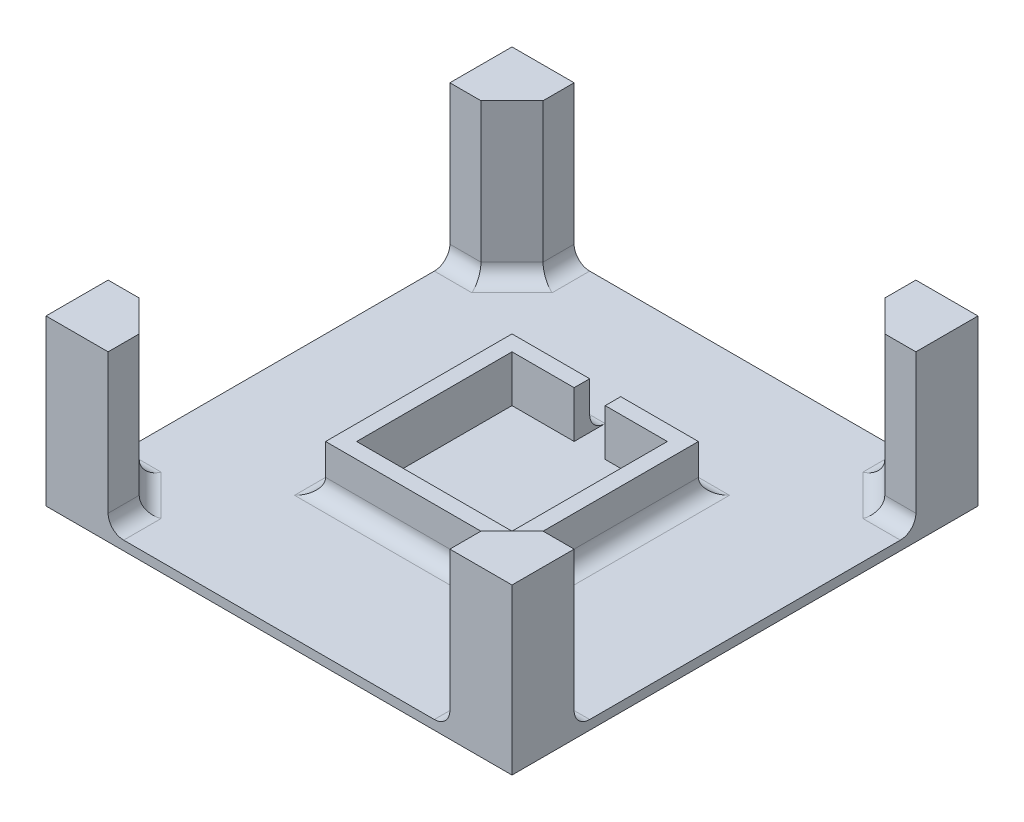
ISO-10303-21;
HEADER;
FILE_DESCRIPTION(('STEP AP214'),'2;1');
FILE_NAME('part.step','',(''),(''),'','','');
FILE_SCHEMA(('AUTOMOTIVE_DESIGN { 1 0 10303 214 1 1 1 1 }'));
ENDSEC;
DATA;
#1=APPLICATION_CONTEXT('core data for automotive mechanical design processes');
#2=APPLICATION_PROTOCOL_DEFINITION('international standard','automotive_design',2000,#1);
#3=PRODUCT_CONTEXT('',#1,'mechanical');
#4=PRODUCT('Part','Part','',(#3));
#5=PRODUCT_RELATED_PRODUCT_CATEGORY('part','',(#4));
#6=PRODUCT_DEFINITION_FORMATION('','',#4);
#7=PRODUCT_DEFINITION_CONTEXT('part definition',#1,'design');
#8=PRODUCT_DEFINITION('design','',#6,#7);
#9=PRODUCT_DEFINITION_SHAPE('','',#8);
#10=(LENGTH_UNIT() NAMED_UNIT(*) SI_UNIT(.MILLI.,.METRE.));
#11=(NAMED_UNIT(*) PLANE_ANGLE_UNIT() SI_UNIT($,.RADIAN.));
#12=(NAMED_UNIT(*) SI_UNIT($,.STERADIAN.) SOLID_ANGLE_UNIT());
#13=UNCERTAINTY_MEASURE_WITH_UNIT(LENGTH_MEASURE(1.E-05),#10,'distance_accuracy_value','');
#14=(GEOMETRIC_REPRESENTATION_CONTEXT(3) GLOBAL_UNCERTAINTY_ASSIGNED_CONTEXT((#13)) GLOBAL_UNIT_ASSIGNED_CONTEXT((#10,
#11,#12)) REPRESENTATION_CONTEXT('',''));
#15=CARTESIAN_POINT('',(0.,0.,0.));
#16=DIRECTION('',(0.,0.,1.));
#17=DIRECTION('',(1.,0.,0.));
#18=AXIS2_PLACEMENT_3D('',#15,#16,#17);
#19=CARTESIAN_POINT('',(35.,6.5,-30.));
#20=DIRECTION('',(0.,0.,-1.));
#21=DIRECTION('',(-1.,0.,0.));
#22=AXIS2_PLACEMENT_3D('',#19,#20,#21);
#23=CYLINDRICAL_SURFACE('',#22,5.);
#24=CARTESIAN_POINT('',(35.,6.5,-35.));
#25=DIRECTION('',(-0.707106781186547,0.,-0.707106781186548));
#26=DIRECTION('',(-0.707106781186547,0.,0.707106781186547));
#27=AXIS2_PLACEMENT_3D('',#24,#25,#26);
#28=ELLIPSE('',#27,7.07106781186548,5.);
#29=CARTESIAN_POINT('',(30.,6.5,-30.));
#30=VERTEX_POINT('',#29);
#31=CARTESIAN_POINT('',(35.,1.5,-35.));
#32=VERTEX_POINT('',#31);
#33=EDGE_CURVE('E54',#30,#32,#28,.F.);
#34=ORIENTED_EDGE('',*,*,#33,.F.);
#35=DIRECTION('',(0.,0.,-1.));
#36=VECTOR('',#35,1.);
#37=CARTESIAN_POINT('',(30.,6.5,-30.));
#38=LINE('',#37,#36);
#39=CARTESIAN_POINT('',(30.,6.5,30.));
#40=VERTEX_POINT('',#39);
#41=EDGE_CURVE('E762',#40,#30,#38,.T.);
#42=ORIENTED_EDGE('',*,*,#41,.F.);
#43=CARTESIAN_POINT('',(35.,6.5,35.));
#44=DIRECTION('',(0.707106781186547,0.,-0.707106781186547));
#45=DIRECTION('',(-0.707106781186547,0.,-0.707106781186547));
#46=AXIS2_PLACEMENT_3D('',#43,#44,#45);
#47=ELLIPSE('',#46,7.07106781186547,5.);
#48=CARTESIAN_POINT('',(35.,1.5,35.));
#49=VERTEX_POINT('',#48);
#50=EDGE_CURVE('E779',#40,#49,#47,.F.);
#51=ORIENTED_EDGE('',*,*,#50,.T.);
#52=DIRECTION('',(0.,0.,-1.));
#53=VECTOR('',#52,1.);
#54=CARTESIAN_POINT('',(35.,1.5,0.));
#55=LINE('',#54,#53);
#56=EDGE_CURVE('E739',#32,#49,#55,.F.);
#57=ORIENTED_EDGE('',*,*,#56,.F.);
#58=EDGE_LOOP('',(#34,#42,#51,#57));
#59=FACE_BOUND('',#58,.T.);
#60=ADVANCED_FACE('F45',(#59),#23,.F.);
#61=CARTESIAN_POINT('',(-30.,6.5,35.));
#62=DIRECTION('',(1.,0.,0.));
#63=DIRECTION('',(0.,0.,-1.));
#64=AXIS2_PLACEMENT_3D('',#61,#62,#63);
#65=CYLINDRICAL_SURFACE('',#64,5.);
#66=ORIENTED_EDGE('',*,*,#50,.F.);
#67=DIRECTION('',(1.,0.,0.));
#68=VECTOR('',#67,1.);
#69=CARTESIAN_POINT('',(-30.,6.5,30.));
#70=LINE('',#69,#68);
#71=CARTESIAN_POINT('',(-30.,6.5,30.));
#72=VERTEX_POINT('',#71);
#73=EDGE_CURVE('E758',#72,#40,#70,.T.);
#74=ORIENTED_EDGE('',*,*,#73,.F.);
#75=CARTESIAN_POINT('',(-35.,6.5,35.));
#76=DIRECTION('',(0.707106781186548,0.,0.707106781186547));
#77=DIRECTION('',(0.707106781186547,0.,-0.707106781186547));
#78=AXIS2_PLACEMENT_3D('',#75,#76,#77);
#79=ELLIPSE('',#78,7.07106781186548,5.);
#80=CARTESIAN_POINT('',(-35.,1.5,35.));
#81=VERTEX_POINT('',#80);
#82=EDGE_CURVE('E776',#72,#81,#79,.F.);
#83=ORIENTED_EDGE('',*,*,#82,.T.);
#84=DIRECTION('',(1.,0.,0.));
#85=VECTOR('',#84,1.);
#86=CARTESIAN_POINT('',(0.,1.5,35.));
#87=LINE('',#86,#85);
#88=EDGE_CURVE('E743',#49,#81,#87,.F.);
#89=ORIENTED_EDGE('',*,*,#88,.F.);
#90=EDGE_LOOP('',(#66,#74,#83,#89));
#91=FACE_BOUND('',#90,.T.);
#92=ADVANCED_FACE('F785',(#91),#65,.F.);
#93=CARTESIAN_POINT('',(-35.,6.5,-30.));
#94=DIRECTION('',(0.,0.,1.));
#95=DIRECTION('',(1.,0.,0.));
#96=AXIS2_PLACEMENT_3D('',#93,#94,#95);
#97=CYLINDRICAL_SURFACE('',#96,5.);
#98=ORIENTED_EDGE('',*,*,#82,.F.);
#99=DIRECTION('',(0.,0.,1.));
#100=VECTOR('',#99,1.);
#101=CARTESIAN_POINT('',(-30.,6.5,-30.));
#102=LINE('',#101,#100);
#103=CARTESIAN_POINT('',(-30.,6.5,-30.));
#104=VERTEX_POINT('',#103);
#105=EDGE_CURVE('E754',#104,#72,#102,.T.);
#106=ORIENTED_EDGE('',*,*,#105,.F.);
#107=CARTESIAN_POINT('',(-35.,6.5,-35.));
#108=DIRECTION('',(-0.707106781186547,0.,0.707106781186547));
#109=DIRECTION('',(0.707106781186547,0.,0.707106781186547));
#110=AXIS2_PLACEMENT_3D('',#107,#108,#109);
#111=ELLIPSE('',#110,7.07106781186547,5.);
#112=CARTESIAN_POINT('',(-35.,1.5,-35.));
#113=VERTEX_POINT('',#112);
#114=EDGE_CURVE('E773',#104,#113,#111,.F.);
#115=ORIENTED_EDGE('',*,*,#114,.T.);
#116=DIRECTION('',(0.,0.,1.));
#117=VECTOR('',#116,1.);
#118=CARTESIAN_POINT('',(-35.,1.5,0.));
#119=LINE('',#118,#117);
#120=EDGE_CURVE('E747',#81,#113,#119,.F.);
#121=ORIENTED_EDGE('',*,*,#120,.F.);
#122=EDGE_LOOP('',(#98,#106,#115,#121));
#123=FACE_BOUND('',#122,.T.);
#124=ADVANCED_FACE('F789',(#123),#97,.F.);
#125=CARTESIAN_POINT('',(-30.,6.5,-35.));
#126=DIRECTION('',(-1.,0.,0.));
#127=DIRECTION('',(0.,0.,1.));
#128=AXIS2_PLACEMENT_3D('',#125,#126,#127);
#129=CYLINDRICAL_SURFACE('',#128,5.);
#130=ORIENTED_EDGE('',*,*,#114,.F.);
#131=DIRECTION('',(-1.,0.,0.));
#132=VECTOR('',#131,1.);
#133=CARTESIAN_POINT('',(-30.,6.5,-30.));
#134=LINE('',#133,#132);
#135=CARTESIAN_POINT('',(-5.,6.5,-30.));
#136=VERTEX_POINT('',#135);
#137=EDGE_CURVE('E732',#136,#104,#134,.T.);
#138=ORIENTED_EDGE('',*,*,#137,.F.);
#139=CARTESIAN_POINT('',(-5.,6.5,-35.));
#140=DIRECTION('',(1.,0.,0.));
#141=DIRECTION('',(0.,1.,0.));
#142=AXIS2_PLACEMENT_3D('',#139,#140,#141);
#143=CIRCLE('',#142,5.);
#144=CARTESIAN_POINT('',(-5.,1.5,-35.));
#145=VERTEX_POINT('',#144);
#146=EDGE_CURVE('E769',#136,#145,#143,.T.);
#147=ORIENTED_EDGE('',*,*,#146,.T.);
#148=DIRECTION('',(-1.,0.,0.));
#149=VECTOR('',#148,1.);
#150=CARTESIAN_POINT('',(0.,1.5,-35.));
#151=LINE('',#150,#149);
#152=EDGE_CURVE('E751',#113,#145,#151,.F.);
#153=ORIENTED_EDGE('',*,*,#152,.F.);
#154=EDGE_LOOP('',(#130,#138,#147,#153));
#155=FACE_BOUND('',#154,.T.);
#156=ADVANCED_FACE('F793',(#155),#129,.F.);
#157=CARTESIAN_POINT('',(-30.,6.5,-35.));
#158=DIRECTION('',(-1.,0.,0.));
#159=DIRECTION('',(0.,0.,1.));
#160=AXIS2_PLACEMENT_3D('',#157,#158,#159);
#161=CYLINDRICAL_SURFACE('',#160,5.);
#162=DIRECTION('',(-1.,0.,0.));
#163=VECTOR('',#162,1.);
#164=CARTESIAN_POINT('',(-30.,6.5,-30.));
#165=LINE('',#164,#163);
#166=CARTESIAN_POINT('',(5.,6.5,-30.));
#167=VERTEX_POINT('',#166);
#168=EDGE_CURVE('E766',#30,#167,#165,.T.);
#169=ORIENTED_EDGE('',*,*,#168,.F.);
#170=ORIENTED_EDGE('',*,*,#33,.T.);
#171=DIRECTION('',(-1.,0.,0.));
#172=VECTOR('',#171,1.);
#173=CARTESIAN_POINT('',(0.,1.5,-35.));
#174=LINE('',#173,#172);
#175=CARTESIAN_POINT('',(5.,1.5,-35.));
#176=VERTEX_POINT('',#175);
#177=EDGE_CURVE('E736',#176,#32,#174,.F.);
#178=ORIENTED_EDGE('',*,*,#177,.F.);
#179=CARTESIAN_POINT('',(5.,6.5,-35.));
#180=DIRECTION('',(1.,0.,0.));
#181=DIRECTION('',(0.,1.,0.));
#182=AXIS2_PLACEMENT_3D('',#179,#180,#181);
#183=CIRCLE('',#182,5.);
#184=EDGE_CURVE('E11',#176,#167,#183,.F.);
#185=ORIENTED_EDGE('',*,*,#184,.T.);
#186=EDGE_LOOP('',(#169,#170,#178,#185));
#187=FACE_BOUND('',#186,.T.);
#188=ADVANCED_FACE('F47',(#187),#161,.F.);
#189=CARTESIAN_POINT('',(56.4644660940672,6.5,56.4644660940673));
#190=DIRECTION('',(-0.707106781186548,0.,0.707106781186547));
#191=DIRECTION('',(0.707106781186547,0.,0.707106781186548));
#192=AXIS2_PLACEMENT_3D('',#189,#190,#191);
#193=CYLINDRICAL_SURFACE('',#192,5.);
#194=CARTESIAN_POINT('',(50.,6.5,62.9289321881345));
#195=DIRECTION('',(-0.38268343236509,0.,0.923879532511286));
#196=DIRECTION('',(0.923879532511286,0.,0.38268343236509));
#197=AXIS2_PLACEMENT_3D('',#194,#195,#196);
#198=ELLIPSE('',#197,5.41196100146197,5.);
#199=CARTESIAN_POINT('',(55.,6.5,65.));
#200=VERTEX_POINT('',#199);
#201=CARTESIAN_POINT('',(50.,1.5,62.9289321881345));
#202=VERTEX_POINT('',#201);
#203=EDGE_CURVE('E726',#200,#202,#198,.F.);
#204=ORIENTED_EDGE('',*,*,#203,.F.);
#205=DIRECTION('',(-0.707106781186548,0.,0.707106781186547));
#206=VECTOR('',#205,1.);
#207=CARTESIAN_POINT('',(59.9999999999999,6.5,60.0000000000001));
#208=LINE('',#207,#206);
#209=CARTESIAN_POINT('',(65.,6.5,55.));
#210=VERTEX_POINT('',#209);
#211=EDGE_CURVE('E712',#210,#200,#208,.T.);
#212=ORIENTED_EDGE('',*,*,#211,.F.);
#213=CARTESIAN_POINT('',(62.9289321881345,6.5,50.));
#214=DIRECTION('',(-0.923879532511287,0.,0.382683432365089));
#215=DIRECTION('',(0.382683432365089,0.,0.923879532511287));
#216=AXIS2_PLACEMENT_3D('',#213,#214,#215);
#217=ELLIPSE('',#216,5.41196100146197,5.);
#218=CARTESIAN_POINT('',(62.9289321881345,1.5,50.));
#219=VERTEX_POINT('',#218);
#220=EDGE_CURVE('E723',#210,#219,#217,.F.);
#221=ORIENTED_EDGE('',*,*,#220,.T.);
#222=DIRECTION('',(-0.707106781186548,0.,0.707106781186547));
#223=VECTOR('',#222,1.);
#224=CARTESIAN_POINT('',(56.4644660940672,1.5,56.4644660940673));
#225=LINE('',#224,#223);
#226=EDGE_CURVE('E704',#202,#219,#225,.F.);
#227=ORIENTED_EDGE('',*,*,#226,.F.);
#228=EDGE_LOOP('',(#204,#212,#221,#227));
#229=FACE_BOUND('',#228,.T.);
#230=ADVANCED_FACE('F895',(#229),#193,.F.);
#231=CARTESIAN_POINT('',(0.,6.5,50.));
#232=DIRECTION('',(-1.,0.,0.));
#233=DIRECTION('',(0.,0.,1.));
#234=AXIS2_PLACEMENT_3D('',#231,#232,#233);
#235=CYLINDRICAL_SURFACE('',#234,5.);
#236=ORIENTED_EDGE('',*,*,#220,.F.);
#237=DIRECTION('',(-1.,0.,0.));
#238=VECTOR('',#237,1.);
#239=CARTESIAN_POINT('',(0.,6.5,55.));
#240=LINE('',#239,#238);
#241=CARTESIAN_POINT('',(75.,6.5,55.));
#242=VERTEX_POINT('',#241);
#243=EDGE_CURVE('E696',#242,#210,#240,.T.);
#244=ORIENTED_EDGE('',*,*,#243,.F.);
#245=CARTESIAN_POINT('',(75.,6.5,50.));
#246=DIRECTION('',(-1.,0.,0.));
#247=DIRECTION('',(0.,0.,1.));
#248=AXIS2_PLACEMENT_3D('',#245,#246,#247);
#249=CIRCLE('',#248,5.);
#250=CARTESIAN_POINT('',(75.,1.5,50.));
#251=VERTEX_POINT('',#250);
#252=EDGE_CURVE('E720',#242,#251,#249,.F.);
#253=ORIENTED_EDGE('',*,*,#252,.T.);
#254=DIRECTION('',(-1.,0.,0.));
#255=VECTOR('',#254,1.);
#256=CARTESIAN_POINT('',(0.,1.5,50.));
#257=LINE('',#256,#255);
#258=EDGE_CURVE('E708',#219,#251,#257,.F.);
#259=ORIENTED_EDGE('',*,*,#258,.F.);
#260=EDGE_LOOP('',(#236,#244,#253,#259));
#261=FACE_BOUND('',#260,.T.);
#262=ADVANCED_FACE('F893',(#261),#235,.F.);
#263=CARTESIAN_POINT('',(50.,6.5,0.));
#264=DIRECTION('',(0.,0.,1.));
#265=DIRECTION('',(1.,0.,0.));
#266=AXIS2_PLACEMENT_3D('',#263,#264,#265);
#267=CYLINDRICAL_SURFACE('',#266,5.);
#268=DIRECTION('',(0.,0.,1.));
#269=VECTOR('',#268,1.);
#270=CARTESIAN_POINT('',(55.,6.5,0.));
#271=LINE('',#270,#269);
#272=CARTESIAN_POINT('',(55.,6.5,75.));
#273=VERTEX_POINT('',#272);
#274=EDGE_CURVE('E716',#200,#273,#271,.T.);
#275=ORIENTED_EDGE('',*,*,#274,.F.);
#276=ORIENTED_EDGE('',*,*,#203,.T.);
#277=DIRECTION('',(0.,0.,1.));
#278=VECTOR('',#277,1.);
#279=CARTESIAN_POINT('',(50.,1.5,0.));
#280=LINE('',#279,#278);
#281=CARTESIAN_POINT('',(50.,1.5,75.));
#282=VERTEX_POINT('',#281);
#283=EDGE_CURVE('E700',#282,#202,#280,.F.);
#284=ORIENTED_EDGE('',*,*,#283,.F.);
#285=CARTESIAN_POINT('',(50.,6.5,75.));
#286=DIRECTION('',(0.,0.,-1.));
#287=DIRECTION('',(-1.,0.,0.));
#288=AXIS2_PLACEMENT_3D('',#285,#286,#287);
#289=CIRCLE('',#288,5.);
#290=EDGE_CURVE('E729',#282,#273,#289,.F.);
#291=ORIENTED_EDGE('',*,*,#290,.T.);
#292=EDGE_LOOP('',(#275,#276,#284,#291));
#293=FACE_BOUND('',#292,.T.);
#294=ADVANCED_FACE('F889',(#293),#267,.F.);
#295=CARTESIAN_POINT('',(-61.4644660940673,6.5,51.4644660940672));
#296=DIRECTION('',(0.707106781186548,0.,0.707106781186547));
#297=DIRECTION('',(0.707106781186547,0.,-0.707106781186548));
#298=AXIS2_PLACEMENT_3D('',#295,#296,#297);
#299=CYLINDRICAL_SURFACE('',#298,5.);
#300=CARTESIAN_POINT('',(-62.9289321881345,6.5,50.));
#301=DIRECTION('',(0.923879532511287,0.,0.382683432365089));
#302=DIRECTION('',(0.382683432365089,0.,-0.923879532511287));
#303=AXIS2_PLACEMENT_3D('',#300,#301,#302);
#304=ELLIPSE('',#303,5.41196100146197,5.);
#305=CARTESIAN_POINT('',(-65.,6.5,55.));
#306=VERTEX_POINT('',#305);
#307=CARTESIAN_POINT('',(-62.9289321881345,1.5,50.));
#308=VERTEX_POINT('',#307);
#309=EDGE_CURVE('E690',#306,#308,#304,.T.);
#310=ORIENTED_EDGE('',*,*,#309,.F.);
#311=DIRECTION('',(-0.707106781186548,0.,-0.707106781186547));
#312=VECTOR('',#311,1.);
#313=CARTESIAN_POINT('',(-65.,6.5,55.));
#314=LINE('',#313,#312);
#315=CARTESIAN_POINT('',(-55.,6.5,65.));
#316=VERTEX_POINT('',#315);
#317=EDGE_CURVE('E676',#316,#306,#314,.T.);
#318=ORIENTED_EDGE('',*,*,#317,.F.);
#319=CARTESIAN_POINT('',(-50.,6.5,62.9289321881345));
#320=DIRECTION('',(0.38268343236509,0.,0.923879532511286));
#321=DIRECTION('',(0.923879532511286,0.,-0.38268343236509));
#322=AXIS2_PLACEMENT_3D('',#319,#320,#321);
#323=ELLIPSE('',#322,5.41196100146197,5.);
#324=CARTESIAN_POINT('',(-50.,1.5,62.9289321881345));
#325=VERTEX_POINT('',#324);
#326=EDGE_CURVE('E687',#316,#325,#323,.T.);
#327=ORIENTED_EDGE('',*,*,#326,.T.);
#328=DIRECTION('',(-0.707106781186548,0.,-0.707106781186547));
#329=VECTOR('',#328,1.);
#330=CARTESIAN_POINT('',(-61.4644660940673,1.5,51.4644660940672));
#331=LINE('',#330,#329);
#332=EDGE_CURVE('E668',#308,#325,#331,.F.);
#333=ORIENTED_EDGE('',*,*,#332,.F.);
#334=EDGE_LOOP('',(#310,#318,#327,#333));
#335=FACE_BOUND('',#334,.T.);
#336=ADVANCED_FACE('F892',(#335),#299,.F.);
#337=CARTESIAN_POINT('',(-50.,6.5,65.));
#338=DIRECTION('',(0.,0.,1.));
#339=DIRECTION('',(1.,0.,0.));
#340=AXIS2_PLACEMENT_3D('',#337,#338,#339);
#341=CYLINDRICAL_SURFACE('',#340,5.);
#342=ORIENTED_EDGE('',*,*,#326,.F.);
#343=DIRECTION('',(0.,0.,-1.));
#344=VECTOR('',#343,1.);
#345=CARTESIAN_POINT('',(-55.,6.5,65.));
#346=LINE('',#345,#344);
#347=CARTESIAN_POINT('',(-55.,6.5,75.));
#348=VERTEX_POINT('',#347);
#349=EDGE_CURVE('E660',#348,#316,#346,.T.);
#350=ORIENTED_EDGE('',*,*,#349,.F.);
#351=CARTESIAN_POINT('',(-50.,6.5,75.));
#352=DIRECTION('',(0.,0.,-1.));
#353=DIRECTION('',(-1.,0.,0.));
#354=AXIS2_PLACEMENT_3D('',#351,#352,#353);
#355=CIRCLE('',#354,5.);
#356=CARTESIAN_POINT('',(-50.,1.5,75.));
#357=VERTEX_POINT('',#356);
#358=EDGE_CURVE('E684',#348,#357,#355,.F.);
#359=ORIENTED_EDGE('',*,*,#358,.T.);
#360=DIRECTION('',(0.,0.,-1.));
#361=VECTOR('',#360,1.);
#362=CARTESIAN_POINT('',(-50.,1.5,65.));
#363=LINE('',#362,#361);
#364=EDGE_CURVE('E672',#325,#357,#363,.F.);
#365=ORIENTED_EDGE('',*,*,#364,.F.);
#366=EDGE_LOOP('',(#342,#350,#359,#365));
#367=FACE_BOUND('',#366,.T.);
#368=ADVANCED_FACE('F906',(#367),#341,.F.);
#369=CARTESIAN_POINT('',(-75.,6.5,50.));
#370=DIRECTION('',(1.,0.,0.));
#371=DIRECTION('',(0.,0.,-1.));
#372=AXIS2_PLACEMENT_3D('',#369,#370,#371);
#373=CYLINDRICAL_SURFACE('',#372,5.);
#374=DIRECTION('',(-1.,0.,0.));
#375=VECTOR('',#374,1.);
#376=CARTESIAN_POINT('',(-75.,6.5,55.));
#377=LINE('',#376,#375);
#378=CARTESIAN_POINT('',(-75.,6.5,55.));
#379=VERTEX_POINT('',#378);
#380=EDGE_CURVE('E680',#306,#379,#377,.T.);
#381=ORIENTED_EDGE('',*,*,#380,.F.);
#382=ORIENTED_EDGE('',*,*,#309,.T.);
#383=DIRECTION('',(-1.,0.,0.));
#384=VECTOR('',#383,1.);
#385=CARTESIAN_POINT('',(-75.,1.5,50.));
#386=LINE('',#385,#384);
#387=CARTESIAN_POINT('',(-75.,1.5,50.));
#388=VERTEX_POINT('',#387);
#389=EDGE_CURVE('E664',#388,#308,#386,.F.);
#390=ORIENTED_EDGE('',*,*,#389,.F.);
#391=CARTESIAN_POINT('',(-75.,6.5,50.));
#392=DIRECTION('',(1.,0.,0.));
#393=DIRECTION('',(0.,0.,-1.));
#394=AXIS2_PLACEMENT_3D('',#391,#392,#393);
#395=CIRCLE('',#394,5.);
#396=EDGE_CURVE('E693',#388,#379,#395,.F.);
#397=ORIENTED_EDGE('',*,*,#396,.T.);
#398=EDGE_LOOP('',(#381,#382,#390,#397));
#399=FACE_BOUND('',#398,.T.);
#400=ADVANCED_FACE('F902',(#399),#373,.F.);
#401=CARTESIAN_POINT('',(56.4644660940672,6.5,-56.4644660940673));
#402=DIRECTION('',(-0.707106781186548,0.,-0.707106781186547));
#403=DIRECTION('',(-0.707106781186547,0.,0.707106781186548));
#404=AXIS2_PLACEMENT_3D('',#401,#402,#403);
#405=CYLINDRICAL_SURFACE('',#404,5.);
#406=CARTESIAN_POINT('',(62.9289321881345,6.5,-50.));
#407=DIRECTION('',(-0.923879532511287,0.,-0.382683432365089));
#408=DIRECTION('',(-0.382683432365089,0.,0.923879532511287));
#409=AXIS2_PLACEMENT_3D('',#406,#407,#408);
#410=ELLIPSE('',#409,5.41196100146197,5.);
#411=CARTESIAN_POINT('',(65.,6.5,-55.));
#412=VERTEX_POINT('',#411);
#413=CARTESIAN_POINT('',(62.9289321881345,1.5,-50.));
#414=VERTEX_POINT('',#413);
#415=EDGE_CURVE('E654',#412,#414,#410,.T.);
#416=ORIENTED_EDGE('',*,*,#415,.F.);
#417=DIRECTION('',(0.707106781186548,0.,0.707106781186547));
#418=VECTOR('',#417,1.);
#419=CARTESIAN_POINT('',(59.9999999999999,6.5,-60.0000000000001));
#420=LINE('',#419,#418);
#421=CARTESIAN_POINT('',(55.,6.5,-65.));
#422=VERTEX_POINT('',#421);
#423=EDGE_CURVE('E640',#422,#412,#420,.T.);
#424=ORIENTED_EDGE('',*,*,#423,.F.);
#425=CARTESIAN_POINT('',(50.,6.5,-62.9289321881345));
#426=DIRECTION('',(-0.38268343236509,0.,-0.923879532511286));
#427=DIRECTION('',(-0.923879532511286,0.,0.38268343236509));
#428=AXIS2_PLACEMENT_3D('',#425,#426,#427);
#429=ELLIPSE('',#428,5.41196100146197,5.);
#430=CARTESIAN_POINT('',(50.,1.5,-62.9289321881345));
#431=VERTEX_POINT('',#430);
#432=EDGE_CURVE('E651',#422,#431,#429,.T.);
#433=ORIENTED_EDGE('',*,*,#432,.T.);
#434=DIRECTION('',(0.707106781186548,0.,0.707106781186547));
#435=VECTOR('',#434,1.);
#436=CARTESIAN_POINT('',(56.4644660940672,1.5,-56.4644660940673));
#437=LINE('',#436,#435);
#438=EDGE_CURVE('E632',#414,#431,#437,.F.);
#439=ORIENTED_EDGE('',*,*,#438,.F.);
#440=EDGE_LOOP('',(#416,#424,#433,#439));
#441=FACE_BOUND('',#440,.T.);
#442=ADVANCED_FACE('F905',(#441),#405,.F.);
#443=CARTESIAN_POINT('',(50.,6.5,0.));
#444=DIRECTION('',(0.,0.,-1.));
#445=DIRECTION('',(-1.,0.,0.));
#446=AXIS2_PLACEMENT_3D('',#443,#444,#445);
#447=CYLINDRICAL_SURFACE('',#446,5.);
#448=ORIENTED_EDGE('',*,*,#432,.F.);
#449=DIRECTION('',(0.,0.,1.));
#450=VECTOR('',#449,1.);
#451=CARTESIAN_POINT('',(55.,6.5,0.));
#452=LINE('',#451,#450);
#453=CARTESIAN_POINT('',(55.,6.5,-75.));
#454=VERTEX_POINT('',#453);
#455=EDGE_CURVE('E624',#454,#422,#452,.T.);
#456=ORIENTED_EDGE('',*,*,#455,.F.);
#457=CARTESIAN_POINT('',(50.,6.5,-75.));
#458=DIRECTION('',(0.,0.,1.));
#459=DIRECTION('',(1.,0.,0.));
#460=AXIS2_PLACEMENT_3D('',#457,#458,#459);
#461=CIRCLE('',#460,5.);
#462=CARTESIAN_POINT('',(50.,1.5,-75.));
#463=VERTEX_POINT('',#462);
#464=EDGE_CURVE('E648',#454,#463,#461,.F.);
#465=ORIENTED_EDGE('',*,*,#464,.T.);
#466=DIRECTION('',(0.,0.,1.));
#467=VECTOR('',#466,1.);
#468=CARTESIAN_POINT('',(50.,1.5,0.));
#469=LINE('',#468,#467);
#470=EDGE_CURVE('E636',#431,#463,#469,.F.);
#471=ORIENTED_EDGE('',*,*,#470,.F.);
#472=EDGE_LOOP('',(#448,#456,#465,#471));
#473=FACE_BOUND('',#472,.T.);
#474=ADVANCED_FACE('F918',(#473),#447,.F.);
#475=CARTESIAN_POINT('',(0.,6.5,-50.));
#476=DIRECTION('',(-1.,0.,0.));
#477=DIRECTION('',(0.,0.,1.));
#478=AXIS2_PLACEMENT_3D('',#475,#476,#477);
#479=CYLINDRICAL_SURFACE('',#478,5.);
#480=DIRECTION('',(1.,0.,0.));
#481=VECTOR('',#480,1.);
#482=CARTESIAN_POINT('',(0.,6.5,-55.));
#483=LINE('',#482,#481);
#484=CARTESIAN_POINT('',(75.,6.5,-55.));
#485=VERTEX_POINT('',#484);
#486=EDGE_CURVE('E644',#412,#485,#483,.T.);
#487=ORIENTED_EDGE('',*,*,#486,.F.);
#488=ORIENTED_EDGE('',*,*,#415,.T.);
#489=DIRECTION('',(1.,0.,0.));
#490=VECTOR('',#489,1.);
#491=CARTESIAN_POINT('',(0.,1.5,-50.));
#492=LINE('',#491,#490);
#493=CARTESIAN_POINT('',(75.,1.5,-50.));
#494=VERTEX_POINT('',#493);
#495=EDGE_CURVE('E628',#494,#414,#492,.F.);
#496=ORIENTED_EDGE('',*,*,#495,.F.);
#497=CARTESIAN_POINT('',(75.,6.5,-50.));
#498=DIRECTION('',(-1.,0.,0.));
#499=DIRECTION('',(0.,0.,1.));
#500=AXIS2_PLACEMENT_3D('',#497,#498,#499);
#501=CIRCLE('',#500,5.);
#502=EDGE_CURVE('E657',#494,#485,#501,.F.);
#503=ORIENTED_EDGE('',*,*,#502,.T.);
#504=EDGE_LOOP('',(#487,#488,#496,#503));
#505=FACE_BOUND('',#504,.T.);
#506=ADVANCED_FACE('F914',(#505),#479,.F.);
#507=CARTESIAN_POINT('',(-56.4644660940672,6.5,-56.4644660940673));
#508=DIRECTION('',(0.707106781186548,0.,-0.707106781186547));
#509=DIRECTION('',(-0.707106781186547,0.,-0.707106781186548));
#510=AXIS2_PLACEMENT_3D('',#507,#508,#509);
#511=CYLINDRICAL_SURFACE('',#510,5.);
#512=CARTESIAN_POINT('',(-50.,6.5,-62.9289321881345));
#513=DIRECTION('',(0.38268343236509,0.,-0.923879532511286));
#514=DIRECTION('',(-0.923879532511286,0.,-0.38268343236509));
#515=AXIS2_PLACEMENT_3D('',#512,#513,#514);
#516=ELLIPSE('',#515,5.41196100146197,5.);
#517=CARTESIAN_POINT('',(-55.,6.5,-65.));
#518=VERTEX_POINT('',#517);
#519=CARTESIAN_POINT('',(-50.,1.5,-62.9289321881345));
#520=VERTEX_POINT('',#519);
#521=EDGE_CURVE('E618',#518,#520,#516,.F.);
#522=ORIENTED_EDGE('',*,*,#521,.F.);
#523=DIRECTION('',(0.707106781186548,0.,-0.707106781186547));
#524=VECTOR('',#523,1.);
#525=CARTESIAN_POINT('',(-59.9999999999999,6.5,-60.0000000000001));
#526=LINE('',#525,#524);
#527=CARTESIAN_POINT('',(-65.,6.5,-55.));
#528=VERTEX_POINT('',#527);
#529=EDGE_CURVE('E604',#528,#518,#526,.T.);
#530=ORIENTED_EDGE('',*,*,#529,.F.);
#531=CARTESIAN_POINT('',(-62.9289321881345,6.5,-50.));
#532=DIRECTION('',(0.923879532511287,0.,-0.382683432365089));
#533=DIRECTION('',(-0.382683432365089,0.,-0.923879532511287));
#534=AXIS2_PLACEMENT_3D('',#531,#532,#533);
#535=ELLIPSE('',#534,5.41196100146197,5.);
#536=CARTESIAN_POINT('',(-62.9289321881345,1.5,-50.));
#537=VERTEX_POINT('',#536);
#538=EDGE_CURVE('E615',#528,#537,#535,.F.);
#539=ORIENTED_EDGE('',*,*,#538,.T.);
#540=DIRECTION('',(0.707106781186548,0.,-0.707106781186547));
#541=VECTOR('',#540,1.);
#542=CARTESIAN_POINT('',(-56.4644660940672,1.5,-56.4644660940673));
#543=LINE('',#542,#541);
#544=EDGE_CURVE('E596',#520,#537,#543,.F.);
#545=ORIENTED_EDGE('',*,*,#544,.F.);
#546=EDGE_LOOP('',(#522,#530,#539,#545));
#547=FACE_BOUND('',#546,.T.);
#548=ADVANCED_FACE('F917',(#547),#511,.F.);
#549=CARTESIAN_POINT('',(0.,6.5,-50.));
#550=DIRECTION('',(1.,0.,0.));
#551=DIRECTION('',(0.,0.,-1.));
#552=AXIS2_PLACEMENT_3D('',#549,#550,#551);
#553=CYLINDRICAL_SURFACE('',#552,5.);
#554=ORIENTED_EDGE('',*,*,#538,.F.);
#555=DIRECTION('',(1.,0.,0.));
#556=VECTOR('',#555,1.);
#557=CARTESIAN_POINT('',(0.,6.5,-55.));
#558=LINE('',#557,#556);
#559=CARTESIAN_POINT('',(-75.,6.5,-55.));
#560=VERTEX_POINT('',#559);
#561=EDGE_CURVE('E588',#560,#528,#558,.T.);
#562=ORIENTED_EDGE('',*,*,#561,.F.);
#563=CARTESIAN_POINT('',(-75.,6.5,-50.));
#564=DIRECTION('',(1.,0.,0.));
#565=DIRECTION('',(0.,0.,-1.));
#566=AXIS2_PLACEMENT_3D('',#563,#564,#565);
#567=CIRCLE('',#566,5.);
#568=CARTESIAN_POINT('',(-75.,1.5,-50.));
#569=VERTEX_POINT('',#568);
#570=EDGE_CURVE('E612',#560,#569,#567,.F.);
#571=ORIENTED_EDGE('',*,*,#570,.T.);
#572=DIRECTION('',(1.,0.,0.));
#573=VECTOR('',#572,1.);
#574=CARTESIAN_POINT('',(0.,1.5,-50.));
#575=LINE('',#574,#573);
#576=EDGE_CURVE('E600',#537,#569,#575,.F.);
#577=ORIENTED_EDGE('',*,*,#576,.F.);
#578=EDGE_LOOP('',(#554,#562,#571,#577));
#579=FACE_BOUND('',#578,.T.);
#580=ADVANCED_FACE('F928',(#579),#553,.F.);
#581=CARTESIAN_POINT('',(-50.,6.5,0.));
#582=DIRECTION('',(0.,0.,-1.));
#583=DIRECTION('',(-1.,0.,0.));
#584=AXIS2_PLACEMENT_3D('',#581,#582,#583);
#585=CYLINDRICAL_SURFACE('',#584,5.);
#586=DIRECTION('',(0.,0.,-1.));
#587=VECTOR('',#586,1.);
#588=CARTESIAN_POINT('',(-55.,6.5,0.));
#589=LINE('',#588,#587);
#590=CARTESIAN_POINT('',(-55.,6.5,-75.));
#591=VERTEX_POINT('',#590);
#592=EDGE_CURVE('E608',#518,#591,#589,.T.);
#593=ORIENTED_EDGE('',*,*,#592,.F.);
#594=ORIENTED_EDGE('',*,*,#521,.T.);
#595=DIRECTION('',(0.,0.,-1.));
#596=VECTOR('',#595,1.);
#597=CARTESIAN_POINT('',(-50.,1.5,0.));
#598=LINE('',#597,#596);
#599=CARTESIAN_POINT('',(-50.,1.5,-75.));
#600=VERTEX_POINT('',#599);
#601=EDGE_CURVE('E592',#600,#520,#598,.F.);
#602=ORIENTED_EDGE('',*,*,#601,.F.);
#603=CARTESIAN_POINT('',(-50.,6.5,-75.));
#604=DIRECTION('',(0.,0.,1.));
#605=DIRECTION('',(1.,0.,0.));
#606=AXIS2_PLACEMENT_3D('',#603,#604,#605);
#607=CIRCLE('',#606,5.);
#608=EDGE_CURVE('E621',#600,#591,#607,.F.);
#609=ORIENTED_EDGE('',*,*,#608,.T.);
#610=EDGE_LOOP('',(#593,#594,#602,#609));
#611=FACE_BOUND('',#610,.T.);
#612=ADVANCED_FACE('F875',(#611),#585,.F.);
#613=CARTESIAN_POINT('',(0.,16.5,0.));
#614=DIRECTION('',(0.,1.,0.));
#615=DIRECTION('',(0.,0.,1.));
#616=AXIS2_PLACEMENT_3D('',#613,#614,#615);
#617=PLANE('',#616);
#618=DIRECTION('',(-1.,0.,0.));
#619=VECTOR('',#618,1.);
#620=CARTESIAN_POINT('',(-25.,16.5,-25.));
#621=LINE('',#620,#619);
#622=CARTESIAN_POINT('',(-5.,16.5,-25.));
#623=VERTEX_POINT('',#622);
#624=CARTESIAN_POINT('',(-25.,16.5,-25.));
#625=VERTEX_POINT('',#624);
#626=EDGE_CURVE('E812',#623,#625,#621,.T.);
#627=ORIENTED_EDGE('',*,*,#626,.F.);
#628=DIRECTION('',(0.,0.,-1.));
#629=VECTOR('',#628,1.);
#630=CARTESIAN_POINT('',(-5.,16.5,75.001));
#631=LINE('',#630,#629);
#632=CARTESIAN_POINT('',(-5.,16.5,-30.));
#633=VERTEX_POINT('',#632);
#634=EDGE_CURVE('E804',#623,#633,#631,.T.);
#635=ORIENTED_EDGE('',*,*,#634,.T.);
#636=DIRECTION('',(-1.,0.,0.));
#637=VECTOR('',#636,1.);
#638=CARTESIAN_POINT('',(-30.,16.5,-30.));
#639=LINE('',#638,#637);
#640=CARTESIAN_POINT('',(-30.,16.5,-30.));
#641=VERTEX_POINT('',#640);
#642=EDGE_CURVE('E387',#633,#641,#639,.T.);
#643=ORIENTED_EDGE('',*,*,#642,.T.);
#644=DIRECTION('',(0.,0.,1.));
#645=VECTOR('',#644,1.);
#646=CARTESIAN_POINT('',(-30.,16.5,-30.));
#647=LINE('',#646,#645);
#648=CARTESIAN_POINT('',(-30.,16.5,30.));
#649=VERTEX_POINT('',#648);
#650=EDGE_CURVE('E377',#641,#649,#647,.T.);
#651=ORIENTED_EDGE('',*,*,#650,.T.);
#652=DIRECTION('',(1.,0.,0.));
#653=VECTOR('',#652,1.);
#654=CARTESIAN_POINT('',(-30.,16.5,30.));
#655=LINE('',#654,#653);
#656=CARTESIAN_POINT('',(30.,16.5,30.));
#657=VERTEX_POINT('',#656);
#658=EDGE_CURVE('E381',#649,#657,#655,.T.);
#659=ORIENTED_EDGE('',*,*,#658,.T.);
#660=DIRECTION('',(0.,0.,-1.));
#661=VECTOR('',#660,1.);
#662=CARTESIAN_POINT('',(30.,16.5,-30.));
#663=LINE('',#662,#661);
#664=CARTESIAN_POINT('',(30.,16.5,-30.));
#665=VERTEX_POINT('',#664);
#666=EDGE_CURVE('E384',#657,#665,#663,.T.);
#667=ORIENTED_EDGE('',*,*,#666,.T.);
#668=CARTESIAN_POINT('',(5.,16.5,-30.));
#669=VERTEX_POINT('',#668);
#670=EDGE_CURVE('E388',#665,#669,#639,.T.);
#671=ORIENTED_EDGE('',*,*,#670,.T.);
#672=DIRECTION('',(0.,0.,-1.));
#673=VECTOR('',#672,1.);
#674=CARTESIAN_POINT('',(5.,16.5,75.001));
#675=LINE('',#674,#673);
#676=CARTESIAN_POINT('',(5.,16.5,-25.));
#677=VERTEX_POINT('',#676);
#678=EDGE_CURVE('E836',#677,#669,#675,.T.);
#679=ORIENTED_EDGE('',*,*,#678,.F.);
#680=CARTESIAN_POINT('',(25.,16.5,-25.));
#681=VERTEX_POINT('',#680);
#682=EDGE_CURVE('E338',#681,#677,#621,.T.);
#683=ORIENTED_EDGE('',*,*,#682,.F.);
#684=DIRECTION('',(0.,0.,-1.));
#685=VECTOR('',#684,1.);
#686=CARTESIAN_POINT('',(25.,16.5,-25.));
#687=LINE('',#686,#685);
#688=CARTESIAN_POINT('',(25.,16.5,25.));
#689=VERTEX_POINT('',#688);
#690=EDGE_CURVE('E360',#689,#681,#687,.T.);
#691=ORIENTED_EDGE('',*,*,#690,.F.);
#692=DIRECTION('',(1.,0.,0.));
#693=VECTOR('',#692,1.);
#694=CARTESIAN_POINT('',(-25.,16.5,25.));
#695=LINE('',#694,#693);
#696=CARTESIAN_POINT('',(-25.,16.5,25.));
#697=VERTEX_POINT('',#696);
#698=EDGE_CURVE('E366',#697,#689,#695,.T.);
#699=ORIENTED_EDGE('',*,*,#698,.F.);
#700=DIRECTION('',(0.,0.,1.));
#701=VECTOR('',#700,1.);
#702=CARTESIAN_POINT('',(-25.,16.5,-25.));
#703=LINE('',#702,#701);
#704=EDGE_CURVE('E828',#625,#697,#703,.T.);
#705=ORIENTED_EDGE('',*,*,#704,.F.);
#706=EDGE_LOOP('',(#627,#635,#643,#651,#659,#667,#671,#679,#683,#691,#699,#705));
#707=FACE_BOUND('',#706,.T.);
#708=ADVANCED_FACE('F849',(#707),#617,.T.);
#709=CARTESIAN_POINT('',(-30.,16.5,-30.));
#710=DIRECTION('',(0.,0.,1.));
#711=DIRECTION('',(1.,0.,0.));
#712=AXIS2_PLACEMENT_3D('',#709,#710,#711);
#713=PLANE('',#712);
#714=DIRECTION('',(0.,-1.,0.));
#715=VECTOR('',#714,1.);
#716=CARTESIAN_POINT('',(-5.,16.5,-30.));
#717=LINE('',#716,#715);
#718=EDGE_CURVE('E798',#633,#136,#717,.T.);
#719=ORIENTED_EDGE('',*,*,#718,.T.);
#720=ORIENTED_EDGE('',*,*,#137,.T.);
#721=DIRECTION('',(0.,-1.,0.));
#722=VECTOR('',#721,1.);
#723=CARTESIAN_POINT('',(-30.,16.5,-30.));
#724=LINE('',#723,#722);
#725=EDGE_CURVE('E392',#641,#104,#724,.T.);
#726=ORIENTED_EDGE('',*,*,#725,.F.);
#727=ORIENTED_EDGE('',*,*,#642,.F.);
#728=EDGE_LOOP('',(#719,#720,#726,#727));
#729=FACE_BOUND('',#728,.T.);
#730=ADVANCED_FACE('F864',(#729),#713,.F.);
#731=CARTESIAN_POINT('',(-25.,16.5,-25.));
#732=DIRECTION('',(0.,0.,1.));
#733=DIRECTION('',(1.,0.,0.));
#734=AXIS2_PLACEMENT_3D('',#731,#732,#733);
#735=PLANE('',#734);
#736=DIRECTION('',(-1.,0.,0.));
#737=VECTOR('',#736,1.);
#738=CARTESIAN_POINT('',(-25.,1.5,-25.));
#739=LINE('',#738,#737);
#740=CARTESIAN_POINT('',(-5.,1.5,-25.));
#741=VERTEX_POINT('',#740);
#742=CARTESIAN_POINT('',(-25.,1.5,-25.));
#743=VERTEX_POINT('',#742);
#744=EDGE_CURVE('E349',#741,#743,#739,.T.);
#745=ORIENTED_EDGE('',*,*,#744,.F.);
#746=DIRECTION('',(0.,-1.,0.));
#747=VECTOR('',#746,1.);
#748=CARTESIAN_POINT('',(-5.,16.5,-25.));
#749=LINE('',#748,#747);
#750=EDGE_CURVE('E801',#623,#741,#749,.T.);
#751=ORIENTED_EDGE('',*,*,#750,.F.);
#752=ORIENTED_EDGE('',*,*,#626,.T.);
#753=DIRECTION('',(0.,-1.,0.));
#754=VECTOR('',#753,1.);
#755=CARTESIAN_POINT('',(-25.,16.5,-25.));
#756=LINE('',#755,#754);
#757=EDGE_CURVE('E370',#625,#743,#756,.T.);
#758=ORIENTED_EDGE('',*,*,#757,.T.);
#759=EDGE_LOOP('',(#745,#751,#752,#758));
#760=FACE_BOUND('',#759,.T.);
#761=ADVANCED_FACE('F809',(#760),#735,.T.);
#762=CARTESIAN_POINT('',(75.,1.5,-75.));
#763=DIRECTION('',(-1.,0.,0.));
#764=DIRECTION('',(0.,0.,1.));
#765=AXIS2_PLACEMENT_3D('',#762,#763,#764);
#766=PLANE('',#765);
#767=DIRECTION('',(0.,0.,-1.));
#768=VECTOR('',#767,1.);
#769=CARTESIAN_POINT('',(75.,-1.5,-75.));
#770=LINE('',#769,#768);
#771=CARTESIAN_POINT('',(75.,-1.5,75.));
#772=VERTEX_POINT('',#771);
#773=CARTESIAN_POINT('',(75.,-1.5,-75.));
#774=VERTEX_POINT('',#773);
#775=EDGE_CURVE('E545',#772,#774,#770,.T.);
#776=ORIENTED_EDGE('',*,*,#775,.T.);
#777=DIRECTION('',(0.,-1.,0.));
#778=VECTOR('',#777,1.);
#779=CARTESIAN_POINT('',(75.,1.5,-75.));
#780=LINE('',#779,#778);
#781=CARTESIAN_POINT('',(75.,51.5,-75.));
#782=VERTEX_POINT('',#781);
#783=EDGE_CURVE('E584',#782,#774,#780,.T.);
#784=ORIENTED_EDGE('',*,*,#783,.F.);
#785=DIRECTION('',(0.,0.,-1.));
#786=VECTOR('',#785,1.);
#787=CARTESIAN_POINT('',(75.,51.5,0.));
#788=LINE('',#787,#786);
#789=CARTESIAN_POINT('',(75.,51.5,-55.));
#790=VERTEX_POINT('',#789);
#791=EDGE_CURVE('E496',#790,#782,#788,.T.);
#792=ORIENTED_EDGE('',*,*,#791,.F.);
#793=DIRECTION('',(0.,-1.,0.));
#794=VECTOR('',#793,1.);
#795=CARTESIAN_POINT('',(75.,51.5,-55.));
#796=LINE('',#795,#794);
#797=EDGE_CURVE('E485',#790,#485,#796,.T.);
#798=ORIENTED_EDGE('',*,*,#797,.T.);
#799=ORIENTED_EDGE('',*,*,#502,.F.);
#800=DIRECTION('',(0.,0.,-1.));
#801=VECTOR('',#800,1.);
#802=CARTESIAN_POINT('',(75.,1.5,-75.));
#803=LINE('',#802,#801);
#804=EDGE_CURVE('E546',#251,#494,#803,.T.);
#805=ORIENTED_EDGE('',*,*,#804,.F.);
#806=ORIENTED_EDGE('',*,*,#252,.F.);
#807=DIRECTION('',(0.,-1.,0.));
#808=VECTOR('',#807,1.);
#809=CARTESIAN_POINT('',(75.,51.5,55.));
#810=LINE('',#809,#808);
#811=CARTESIAN_POINT('',(75.,51.5,55.));
#812=VERTEX_POINT('',#811);
#813=EDGE_CURVE('E444',#812,#242,#810,.T.);
#814=ORIENTED_EDGE('',*,*,#813,.F.);
#815=DIRECTION('',(0.,0.,-1.));
#816=VECTOR('',#815,1.);
#817=CARTESIAN_POINT('',(75.,51.5,0.));
#818=LINE('',#817,#816);
#819=CARTESIAN_POINT('',(75.,51.5,75.));
#820=VERTEX_POINT('',#819);
#821=EDGE_CURVE('E473',#820,#812,#818,.T.);
#822=ORIENTED_EDGE('',*,*,#821,.F.);
#823=DIRECTION('',(0.,-1.,0.));
#824=VECTOR('',#823,1.);
#825=CARTESIAN_POINT('',(75.,1.5,75.));
#826=LINE('',#825,#824);
#827=EDGE_CURVE('E561',#820,#772,#826,.T.);
#828=ORIENTED_EDGE('',*,*,#827,.T.);
#829=EDGE_LOOP('',(#776,#784,#792,#798,#799,#805,#806,#814,#822,#828));
#830=FACE_BOUND('',#829,.T.);
#831=ADVANCED_FACE('F873',(#830),#766,.F.);
#832=CARTESIAN_POINT('',(-75.,1.5,-75.));
#833=DIRECTION('',(0.,0.,1.));
#834=DIRECTION('',(1.,0.,0.));
#835=AXIS2_PLACEMENT_3D('',#832,#833,#834);
#836=PLANE('',#835);
#837=DIRECTION('',(-1.,0.,0.));
#838=VECTOR('',#837,1.);
#839=CARTESIAN_POINT('',(-75.,-1.5,-75.));
#840=LINE('',#839,#838);
#841=CARTESIAN_POINT('',(-75.,-1.5,-75.));
#842=VERTEX_POINT('',#841);
#843=EDGE_CURVE('E565',#774,#842,#840,.T.);
#844=ORIENTED_EDGE('',*,*,#843,.T.);
#845=DIRECTION('',(0.,-1.,0.));
#846=VECTOR('',#845,1.);
#847=CARTESIAN_POINT('',(-75.,1.5,-75.));
#848=LINE('',#847,#846);
#849=CARTESIAN_POINT('',(-75.,51.5,-75.));
#850=VERTEX_POINT('',#849);
#851=EDGE_CURVE('E580',#850,#842,#848,.T.);
#852=ORIENTED_EDGE('',*,*,#851,.F.);
#853=DIRECTION('',(-1.,0.,0.));
#854=VECTOR('',#853,1.);
#855=CARTESIAN_POINT('',(0.,51.5,-75.));
#856=LINE('',#855,#854);
#857=CARTESIAN_POINT('',(-55.,51.5,-75.));
#858=VERTEX_POINT('',#857);
#859=EDGE_CURVE('E525',#858,#850,#856,.T.);
#860=ORIENTED_EDGE('',*,*,#859,.F.);
#861=DIRECTION('',(0.,-1.,0.));
#862=VECTOR('',#861,1.);
#863=CARTESIAN_POINT('',(-55.,51.5,-75.));
#864=LINE('',#863,#862);
#865=EDGE_CURVE('E529',#858,#591,#864,.T.);
#866=ORIENTED_EDGE('',*,*,#865,.T.);
#867=ORIENTED_EDGE('',*,*,#608,.F.);
#868=DIRECTION('',(-1.,0.,0.));
#869=VECTOR('',#868,1.);
#870=CARTESIAN_POINT('',(-75.,1.5,-75.));
#871=LINE('',#870,#869);
#872=EDGE_CURVE('E549',#463,#600,#871,.T.);
#873=ORIENTED_EDGE('',*,*,#872,.F.);
#874=ORIENTED_EDGE('',*,*,#464,.F.);
#875=DIRECTION('',(0.,-1.,0.));
#876=VECTOR('',#875,1.);
#877=CARTESIAN_POINT('',(55.,51.5,-75.));
#878=LINE('',#877,#876);
#879=CARTESIAN_POINT('',(55.,51.5,-75.));
#880=VERTEX_POINT('',#879);
#881=EDGE_CURVE('E489',#880,#454,#878,.T.);
#882=ORIENTED_EDGE('',*,*,#881,.F.);
#883=DIRECTION('',(-1.,0.,0.));
#884=VECTOR('',#883,1.);
#885=CARTESIAN_POINT('',(0.,51.5,-75.));
#886=LINE('',#885,#884);
#887=EDGE_CURVE('E493',#782,#880,#886,.T.);
#888=ORIENTED_EDGE('',*,*,#887,.F.);
#889=ORIENTED_EDGE('',*,*,#783,.T.);
#890=EDGE_LOOP('',(#844,#852,#860,#866,#867,#873,#874,#882,#888,#889));
#891=FACE_BOUND('',#890,.T.);
#892=ADVANCED_FACE('F938',(#891),#836,.F.);
#893=CARTESIAN_POINT('',(-75.,1.5,-75.));
#894=DIRECTION('',(1.,0.,0.));
#895=DIRECTION('',(0.,0.,-1.));
#896=AXIS2_PLACEMENT_3D('',#893,#894,#895);
#897=PLANE('',#896);
#898=DIRECTION('',(0.,0.,1.));
#899=VECTOR('',#898,1.);
#900=CARTESIAN_POINT('',(-75.,-1.5,-75.));
#901=LINE('',#900,#899);
#902=CARTESIAN_POINT('',(-75.,-1.5,75.));
#903=VERTEX_POINT('',#902);
#904=EDGE_CURVE('E568',#842,#903,#901,.T.);
#905=ORIENTED_EDGE('',*,*,#904,.T.);
#906=DIRECTION('',(0.,-1.,0.));
#907=VECTOR('',#906,1.);
#908=CARTESIAN_POINT('',(-75.,1.5,75.));
#909=LINE('',#908,#907);
#910=CARTESIAN_POINT('',(-75.,51.5,75.));
#911=VERTEX_POINT('',#910);
#912=EDGE_CURVE('E576',#911,#903,#909,.T.);
#913=ORIENTED_EDGE('',*,*,#912,.F.);
#914=DIRECTION('',(0.,0.,-1.));
#915=VECTOR('',#914,1.);
#916=CARTESIAN_POINT('',(-75.,51.5,75.));
#917=LINE('',#916,#915);
#918=CARTESIAN_POINT('',(-75.,51.5,55.));
#919=VERTEX_POINT('',#918);
#920=EDGE_CURVE('E413',#911,#919,#917,.T.);
#921=ORIENTED_EDGE('',*,*,#920,.T.);
#922=DIRECTION('',(0.,-1.,0.));
#923=VECTOR('',#922,1.);
#924=CARTESIAN_POINT('',(-75.,51.5,55.));
#925=LINE('',#924,#923);
#926=EDGE_CURVE('E408',#919,#379,#925,.T.);
#927=ORIENTED_EDGE('',*,*,#926,.T.);
#928=ORIENTED_EDGE('',*,*,#396,.F.);
#929=DIRECTION('',(0.,0.,1.));
#930=VECTOR('',#929,1.);
#931=CARTESIAN_POINT('',(-75.,1.5,-75.));
#932=LINE('',#931,#930);
#933=EDGE_CURVE('E553',#569,#388,#932,.T.);
#934=ORIENTED_EDGE('',*,*,#933,.F.);
#935=ORIENTED_EDGE('',*,*,#570,.F.);
#936=DIRECTION('',(0.,-1.,0.));
#937=VECTOR('',#936,1.);
#938=CARTESIAN_POINT('',(-75.,51.5,-55.));
#939=LINE('',#938,#937);
#940=CARTESIAN_POINT('',(-75.,51.5,-55.));
#941=VERTEX_POINT('',#940);
#942=EDGE_CURVE('E541',#941,#560,#939,.T.);
#943=ORIENTED_EDGE('',*,*,#942,.F.);
#944=DIRECTION('',(0.,0.,1.));
#945=VECTOR('',#944,1.);
#946=CARTESIAN_POINT('',(-75.,51.5,0.));
#947=LINE('',#946,#945);
#948=EDGE_CURVE('E512',#850,#941,#947,.T.);
#949=ORIENTED_EDGE('',*,*,#948,.F.);
#950=ORIENTED_EDGE('',*,*,#851,.T.);
#951=EDGE_LOOP('',(#905,#913,#921,#927,#928,#934,#935,#943,#949,#950));
#952=FACE_BOUND('',#951,.T.);
#953=ADVANCED_FACE('F942',(#952),#897,.F.);
#954=CARTESIAN_POINT('',(-75.,1.5,75.));
#955=DIRECTION('',(0.,0.,-1.));
#956=DIRECTION('',(-1.,0.,0.));
#957=AXIS2_PLACEMENT_3D('',#954,#955,#956);
#958=PLANE('',#957);
#959=DIRECTION('',(1.,0.,0.));
#960=VECTOR('',#959,1.);
#961=CARTESIAN_POINT('',(-75.,-1.5,75.));
#962=LINE('',#961,#960);
#963=EDGE_CURVE('E550',#903,#772,#962,.T.);
#964=ORIENTED_EDGE('',*,*,#963,.T.);
#965=ORIENTED_EDGE('',*,*,#827,.F.);
#966=DIRECTION('',(1.,0.,0.));
#967=VECTOR('',#966,1.);
#968=CARTESIAN_POINT('',(0.,51.5,75.));
#969=LINE('',#968,#967);
#970=CARTESIAN_POINT('',(55.,51.5,75.));
#971=VERTEX_POINT('',#970);
#972=EDGE_CURVE('E460',#971,#820,#969,.T.);
#973=ORIENTED_EDGE('',*,*,#972,.F.);
#974=DIRECTION('',(0.,-1.,0.));
#975=VECTOR('',#974,1.);
#976=CARTESIAN_POINT('',(55.,51.5,75.));
#977=LINE('',#976,#975);
#978=EDGE_CURVE('E456',#971,#273,#977,.T.);
#979=ORIENTED_EDGE('',*,*,#978,.T.);
#980=ORIENTED_EDGE('',*,*,#290,.F.);
#981=DIRECTION('',(1.,0.,0.));
#982=VECTOR('',#981,1.);
#983=CARTESIAN_POINT('',(-75.,1.5,75.));
#984=LINE('',#983,#982);
#985=EDGE_CURVE('E557',#357,#282,#984,.T.);
#986=ORIENTED_EDGE('',*,*,#985,.F.);
#987=ORIENTED_EDGE('',*,*,#358,.F.);
#988=DIRECTION('',(0.,-1.,0.));
#989=VECTOR('',#988,1.);
#990=CARTESIAN_POINT('',(-55.,51.5,75.));
#991=LINE('',#990,#989);
#992=CARTESIAN_POINT('',(-55.,51.5,75.));
#993=VERTEX_POINT('',#992);
#994=EDGE_CURVE('E418',#993,#348,#991,.T.);
#995=ORIENTED_EDGE('',*,*,#994,.F.);
#996=DIRECTION('',(-1.,0.,0.));
#997=VECTOR('',#996,1.);
#998=CARTESIAN_POINT('',(-55.,51.5,75.));
#999=LINE('',#998,#997);
#1000=EDGE_CURVE('E428',#993,#911,#999,.T.);
#1001=ORIENTED_EDGE('',*,*,#1000,.T.);
#1002=ORIENTED_EDGE('',*,*,#912,.T.);
#1003=EDGE_LOOP('',(#964,#965,#973,#979,#980,#986,#987,#995,#1001,#1002));
#1004=FACE_BOUND('',#1003,.T.);
#1005=ADVANCED_FACE('F946',(#1004),#958,.F.);
#1006=CARTESIAN_POINT('',(0.,-1.5,0.));
#1007=DIRECTION('',(0.,1.,0.));
#1008=DIRECTION('',(0.,0.,1.));
#1009=AXIS2_PLACEMENT_3D('',#1006,#1007,#1008);
#1010=PLANE('',#1009);
#1011=ORIENTED_EDGE('',*,*,#775,.F.);
#1012=ORIENTED_EDGE('',*,*,#963,.F.);
#1013=ORIENTED_EDGE('',*,*,#904,.F.);
#1014=ORIENTED_EDGE('',*,*,#843,.F.);
#1015=EDGE_LOOP('',(#1011,#1012,#1013,#1014));
#1016=FACE_BOUND('',#1015,.T.);
#1017=ADVANCED_FACE('F950',(#1016),#1010,.F.);
#1018=CARTESIAN_POINT('',(0.,51.5,-55.));
#1019=DIRECTION('',(0.,0.,-1.));
#1020=DIRECTION('',(-1.,0.,0.));
#1021=AXIS2_PLACEMENT_3D('',#1018,#1019,#1020);
#1022=PLANE('',#1021);
#1023=ORIENTED_EDGE('',*,*,#942,.T.);
#1024=ORIENTED_EDGE('',*,*,#561,.T.);
#1025=DIRECTION('',(0.,-1.,0.));
#1026=VECTOR('',#1025,1.);
#1027=CARTESIAN_POINT('',(-65.,51.5,-55.));
#1028=LINE('',#1027,#1026);
#1029=CARTESIAN_POINT('',(-65.,51.5,-55.));
#1030=VERTEX_POINT('',#1029);
#1031=EDGE_CURVE('E537',#1030,#528,#1028,.T.);
#1032=ORIENTED_EDGE('',*,*,#1031,.F.);
#1033=DIRECTION('',(1.,0.,0.));
#1034=VECTOR('',#1033,1.);
#1035=CARTESIAN_POINT('',(0.,51.5,-55.));
#1036=LINE('',#1035,#1034);
#1037=EDGE_CURVE('E516',#941,#1030,#1036,.T.);
#1038=ORIENTED_EDGE('',*,*,#1037,.F.);
#1039=EDGE_LOOP('',(#1023,#1024,#1032,#1038));
#1040=FACE_BOUND('',#1039,.T.);
#1041=ADVANCED_FACE('F954',(#1040),#1022,.F.);
#1042=CARTESIAN_POINT('',(-59.9999999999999,51.5,-60.0000000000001));
#1043=DIRECTION('',(-0.707106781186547,0.,-0.707106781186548));
#1044=DIRECTION('',(-0.707106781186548,0.,0.707106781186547));
#1045=AXIS2_PLACEMENT_3D('',#1042,#1043,#1044);
#1046=PLANE('',#1045);
#1047=ORIENTED_EDGE('',*,*,#1031,.T.);
#1048=ORIENTED_EDGE('',*,*,#529,.T.);
#1049=DIRECTION('',(0.,-1.,0.));
#1050=VECTOR('',#1049,1.);
#1051=CARTESIAN_POINT('',(-55.,51.5,-65.));
#1052=LINE('',#1051,#1050);
#1053=CARTESIAN_POINT('',(-55.,51.5,-65.));
#1054=VERTEX_POINT('',#1053);
#1055=EDGE_CURVE('E533',#1054,#518,#1052,.T.);
#1056=ORIENTED_EDGE('',*,*,#1055,.F.);
#1057=DIRECTION('',(0.707106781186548,0.,-0.707106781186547));
#1058=VECTOR('',#1057,1.);
#1059=CARTESIAN_POINT('',(-59.9999999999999,51.5,-60.0000000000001));
#1060=LINE('',#1059,#1058);
#1061=EDGE_CURVE('E519',#1030,#1054,#1060,.T.);
#1062=ORIENTED_EDGE('',*,*,#1061,.F.);
#1063=EDGE_LOOP('',(#1047,#1048,#1056,#1062));
#1064=FACE_BOUND('',#1063,.T.);
#1065=ADVANCED_FACE('F960',(#1064),#1046,.F.);
#1066=CARTESIAN_POINT('',(-55.,51.5,0.));
#1067=DIRECTION('',(-1.,0.,0.));
#1068=DIRECTION('',(0.,0.,1.));
#1069=AXIS2_PLACEMENT_3D('',#1066,#1067,#1068);
#1070=PLANE('',#1069);
#1071=ORIENTED_EDGE('',*,*,#1055,.T.);
#1072=ORIENTED_EDGE('',*,*,#592,.T.);
#1073=ORIENTED_EDGE('',*,*,#865,.F.);
#1074=DIRECTION('',(0.,0.,-1.));
#1075=VECTOR('',#1074,1.);
#1076=CARTESIAN_POINT('',(-55.,51.5,0.));
#1077=LINE('',#1076,#1075);
#1078=EDGE_CURVE('E522',#1054,#858,#1077,.T.);
#1079=ORIENTED_EDGE('',*,*,#1078,.F.);
#1080=EDGE_LOOP('',(#1071,#1072,#1073,#1079));
#1081=FACE_BOUND('',#1080,.T.);
#1082=ADVANCED_FACE('F964',(#1081),#1070,.F.);
#1083=CARTESIAN_POINT('',(0.,51.5,0.));
#1084=DIRECTION('',(0.,1.,0.));
#1085=DIRECTION('',(0.,0.,1.));
#1086=AXIS2_PLACEMENT_3D('',#1083,#1084,#1085);
#1087=PLANE('',#1086);
#1088=ORIENTED_EDGE('',*,*,#948,.T.);
#1089=ORIENTED_EDGE('',*,*,#1037,.T.);
#1090=ORIENTED_EDGE('',*,*,#1061,.T.);
#1091=ORIENTED_EDGE('',*,*,#1078,.T.);
#1092=ORIENTED_EDGE('',*,*,#859,.T.);
#1093=EDGE_LOOP('',(#1088,#1089,#1090,#1091,#1092));
#1094=FACE_BOUND('',#1093,.T.);
#1095=ADVANCED_FACE('F968',(#1094),#1087,.T.);
#1096=CARTESIAN_POINT('',(55.,51.5,0.));
#1097=DIRECTION('',(-1.,0.,0.));
#1098=DIRECTION('',(0.,0.,1.));
#1099=AXIS2_PLACEMENT_3D('',#1096,#1097,#1098);
#1100=PLANE('',#1099);
#1101=ORIENTED_EDGE('',*,*,#881,.T.);
#1102=ORIENTED_EDGE('',*,*,#455,.T.);
#1103=DIRECTION('',(0.,-1.,0.));
#1104=VECTOR('',#1103,1.);
#1105=CARTESIAN_POINT('',(55.,51.5,-65.));
#1106=LINE('',#1105,#1104);
#1107=CARTESIAN_POINT('',(55.,51.5,-65.));
#1108=VERTEX_POINT('',#1107);
#1109=EDGE_CURVE('E477',#1108,#422,#1106,.T.);
#1110=ORIENTED_EDGE('',*,*,#1109,.F.);
#1111=DIRECTION('',(0.,0.,-1.));
#1112=VECTOR('',#1111,1.);
#1113=CARTESIAN_POINT('',(55.,51.5,0.));
#1114=LINE('',#1113,#1112);
#1115=EDGE_CURVE('E508',#1108,#880,#1114,.T.);
#1116=ORIENTED_EDGE('',*,*,#1115,.T.);
#1117=EDGE_LOOP('',(#1101,#1102,#1110,#1116));
#1118=FACE_BOUND('',#1117,.T.);
#1119=ADVANCED_FACE('F972',(#1118),#1100,.T.);
#1120=CARTESIAN_POINT('',(59.9999999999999,51.5,-60.0000000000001));
#1121=DIRECTION('',(-0.707106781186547,0.,0.707106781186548));
#1122=DIRECTION('',(0.707106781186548,0.,0.707106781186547));
#1123=AXIS2_PLACEMENT_3D('',#1120,#1121,#1122);
#1124=PLANE('',#1123);
#1125=ORIENTED_EDGE('',*,*,#1109,.T.);
#1126=ORIENTED_EDGE('',*,*,#423,.T.);
#1127=DIRECTION('',(0.,-1.,0.));
#1128=VECTOR('',#1127,1.);
#1129=CARTESIAN_POINT('',(65.,51.5,-55.));
#1130=LINE('',#1129,#1128);
#1131=CARTESIAN_POINT('',(65.,51.5,-55.));
#1132=VERTEX_POINT('',#1131);
#1133=EDGE_CURVE('E481',#1132,#412,#1130,.T.);
#1134=ORIENTED_EDGE('',*,*,#1133,.F.);
#1135=DIRECTION('',(-0.707106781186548,0.,-0.707106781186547));
#1136=VECTOR('',#1135,1.);
#1137=CARTESIAN_POINT('',(59.9999999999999,51.5,-60.0000000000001));
#1138=LINE('',#1137,#1136);
#1139=EDGE_CURVE('E504',#1132,#1108,#1138,.T.);
#1140=ORIENTED_EDGE('',*,*,#1139,.T.);
#1141=EDGE_LOOP('',(#1125,#1126,#1134,#1140));
#1142=FACE_BOUND('',#1141,.T.);
#1143=ADVANCED_FACE('F982',(#1142),#1124,.T.);
#1144=CARTESIAN_POINT('',(0.,51.5,-55.));
#1145=DIRECTION('',(0.,0.,1.));
#1146=DIRECTION('',(1.,0.,0.));
#1147=AXIS2_PLACEMENT_3D('',#1144,#1145,#1146);
#1148=PLANE('',#1147);
#1149=ORIENTED_EDGE('',*,*,#1133,.T.);
#1150=ORIENTED_EDGE('',*,*,#486,.T.);
#1151=ORIENTED_EDGE('',*,*,#797,.F.);
#1152=DIRECTION('',(-1.,0.,0.));
#1153=VECTOR('',#1152,1.);
#1154=CARTESIAN_POINT('',(0.,51.5,-55.));
#1155=LINE('',#1154,#1153);
#1156=EDGE_CURVE('E500',#790,#1132,#1155,.T.);
#1157=ORIENTED_EDGE('',*,*,#1156,.T.);
#1158=EDGE_LOOP('',(#1149,#1150,#1151,#1157));
#1159=FACE_BOUND('',#1158,.T.);
#1160=ADVANCED_FACE('F978',(#1159),#1148,.T.);
#1161=CARTESIAN_POINT('',(0.,51.5,0.));
#1162=DIRECTION('',(0.,1.,0.));
#1163=DIRECTION('',(0.,0.,1.));
#1164=AXIS2_PLACEMENT_3D('',#1161,#1162,#1163);
#1165=PLANE('',#1164);
#1166=ORIENTED_EDGE('',*,*,#1115,.F.);
#1167=ORIENTED_EDGE('',*,*,#1139,.F.);
#1168=ORIENTED_EDGE('',*,*,#1156,.F.);
#1169=ORIENTED_EDGE('',*,*,#791,.T.);
#1170=ORIENTED_EDGE('',*,*,#887,.T.);
#1171=EDGE_LOOP('',(#1166,#1167,#1168,#1169,#1170));
#1172=FACE_BOUND('',#1171,.T.);
#1173=ADVANCED_FACE('F974',(#1172),#1165,.T.);
#1174=CARTESIAN_POINT('',(0.,51.5,55.));
#1175=DIRECTION('',(0.,0.,1.));
#1176=DIRECTION('',(1.,0.,0.));
#1177=AXIS2_PLACEMENT_3D('',#1174,#1175,#1176);
#1178=PLANE('',#1177);
#1179=ORIENTED_EDGE('',*,*,#813,.T.);
#1180=ORIENTED_EDGE('',*,*,#243,.T.);
#1181=DIRECTION('',(0.,-1.,0.));
#1182=VECTOR('',#1181,1.);
#1183=CARTESIAN_POINT('',(65.,51.5,55.));
#1184=LINE('',#1183,#1182);
#1185=CARTESIAN_POINT('',(65.,51.5,55.));
#1186=VERTEX_POINT('',#1185);
#1187=EDGE_CURVE('E448',#1186,#210,#1184,.T.);
#1188=ORIENTED_EDGE('',*,*,#1187,.F.);
#1189=DIRECTION('',(-1.,0.,0.));
#1190=VECTOR('',#1189,1.);
#1191=CARTESIAN_POINT('',(0.,51.5,55.));
#1192=LINE('',#1191,#1190);
#1193=EDGE_CURVE('E470',#812,#1186,#1192,.T.);
#1194=ORIENTED_EDGE('',*,*,#1193,.F.);
#1195=EDGE_LOOP('',(#1179,#1180,#1188,#1194));
#1196=FACE_BOUND('',#1195,.T.);
#1197=ADVANCED_FACE('F977',(#1196),#1178,.F.);
#1198=CARTESIAN_POINT('',(59.9999999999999,51.5,60.0000000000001));
#1199=DIRECTION('',(0.707106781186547,0.,0.707106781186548));
#1200=DIRECTION('',(0.707106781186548,0.,-0.707106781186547));
#1201=AXIS2_PLACEMENT_3D('',#1198,#1199,#1200);
#1202=PLANE('',#1201);
#1203=ORIENTED_EDGE('',*,*,#1187,.T.);
#1204=ORIENTED_EDGE('',*,*,#211,.T.);
#1205=DIRECTION('',(0.,-1.,0.));
#1206=VECTOR('',#1205,1.);
#1207=CARTESIAN_POINT('',(55.,51.5,65.));
#1208=LINE('',#1207,#1206);
#1209=CARTESIAN_POINT('',(55.,51.5,65.));
#1210=VERTEX_POINT('',#1209);
#1211=EDGE_CURVE('E452',#1210,#200,#1208,.T.);
#1212=ORIENTED_EDGE('',*,*,#1211,.F.);
#1213=DIRECTION('',(-0.707106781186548,0.,0.707106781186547));
#1214=VECTOR('',#1213,1.);
#1215=CARTESIAN_POINT('',(59.9999999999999,51.5,60.0000000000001));
#1216=LINE('',#1215,#1214);
#1217=EDGE_CURVE('E467',#1186,#1210,#1216,.T.);
#1218=ORIENTED_EDGE('',*,*,#1217,.F.);
#1219=EDGE_LOOP('',(#1203,#1204,#1212,#1218));
#1220=FACE_BOUND('',#1219,.T.);
#1221=ADVANCED_FACE('F998',(#1220),#1202,.F.);
#1222=CARTESIAN_POINT('',(55.,51.5,0.));
#1223=DIRECTION('',(1.,0.,0.));
#1224=DIRECTION('',(0.,0.,-1.));
#1225=AXIS2_PLACEMENT_3D('',#1222,#1223,#1224);
#1226=PLANE('',#1225);
#1227=ORIENTED_EDGE('',*,*,#1211,.T.);
#1228=ORIENTED_EDGE('',*,*,#274,.T.);
#1229=ORIENTED_EDGE('',*,*,#978,.F.);
#1230=DIRECTION('',(0.,0.,1.));
#1231=VECTOR('',#1230,1.);
#1232=CARTESIAN_POINT('',(55.,51.5,0.));
#1233=LINE('',#1232,#1231);
#1234=EDGE_CURVE('E464',#1210,#971,#1233,.T.);
#1235=ORIENTED_EDGE('',*,*,#1234,.F.);
#1236=EDGE_LOOP('',(#1227,#1228,#1229,#1235));
#1237=FACE_BOUND('',#1236,.T.);
#1238=ADVANCED_FACE('F994',(#1237),#1226,.F.);
#1239=CARTESIAN_POINT('',(0.,51.5,0.));
#1240=DIRECTION('',(0.,1.,0.));
#1241=DIRECTION('',(0.,0.,1.));
#1242=AXIS2_PLACEMENT_3D('',#1239,#1240,#1241);
#1243=PLANE('',#1242);
#1244=ORIENTED_EDGE('',*,*,#821,.T.);
#1245=ORIENTED_EDGE('',*,*,#1193,.T.);
#1246=ORIENTED_EDGE('',*,*,#1217,.T.);
#1247=ORIENTED_EDGE('',*,*,#1234,.T.);
#1248=ORIENTED_EDGE('',*,*,#972,.T.);
#1249=EDGE_LOOP('',(#1244,#1245,#1246,#1247,#1248));
#1250=FACE_BOUND('',#1249,.T.);
#1251=ADVANCED_FACE('F990',(#1250),#1243,.T.);
#1252=CARTESIAN_POINT('',(-75.,51.5,55.));
#1253=DIRECTION('',(0.,0.,-1.));
#1254=DIRECTION('',(-1.,0.,0.));
#1255=AXIS2_PLACEMENT_3D('',#1252,#1253,#1254);
#1256=PLANE('',#1255);
#1257=DIRECTION('',(0.,-1.,0.));
#1258=VECTOR('',#1257,1.);
#1259=CARTESIAN_POINT('',(-65.,51.5,55.));
#1260=LINE('',#1259,#1258);
#1261=CARTESIAN_POINT('',(-65.,51.5,55.));
#1262=VERTEX_POINT('',#1261);
#1263=EDGE_CURVE('E409',#1262,#306,#1260,.T.);
#1264=ORIENTED_EDGE('',*,*,#1263,.T.);
#1265=ORIENTED_EDGE('',*,*,#380,.T.);
#1266=ORIENTED_EDGE('',*,*,#926,.F.);
#1267=DIRECTION('',(1.,0.,0.));
#1268=VECTOR('',#1267,1.);
#1269=CARTESIAN_POINT('',(-75.,51.5,55.));
#1270=LINE('',#1269,#1268);
#1271=EDGE_CURVE('E440',#919,#1262,#1270,.T.);
#1272=ORIENTED_EDGE('',*,*,#1271,.T.);
#1273=EDGE_LOOP('',(#1264,#1265,#1266,#1272));
#1274=FACE_BOUND('',#1273,.T.);
#1275=ADVANCED_FACE('F993',(#1274),#1256,.T.);
#1276=CARTESIAN_POINT('',(-55.,51.5,65.));
#1277=DIRECTION('',(1.,0.,0.));
#1278=DIRECTION('',(0.,0.,-1.));
#1279=AXIS2_PLACEMENT_3D('',#1276,#1277,#1278);
#1280=PLANE('',#1279);
#1281=ORIENTED_EDGE('',*,*,#994,.T.);
#1282=ORIENTED_EDGE('',*,*,#349,.T.);
#1283=DIRECTION('',(0.,-1.,0.));
#1284=VECTOR('',#1283,1.);
#1285=CARTESIAN_POINT('',(-55.,51.5,65.));
#1286=LINE('',#1285,#1284);
#1287=CARTESIAN_POINT('',(-55.,51.5,65.));
#1288=VERTEX_POINT('',#1287);
#1289=EDGE_CURVE('E414',#1288,#316,#1286,.T.);
#1290=ORIENTED_EDGE('',*,*,#1289,.F.);
#1291=DIRECTION('',(0.,0.,1.));
#1292=VECTOR('',#1291,1.);
#1293=CARTESIAN_POINT('',(-55.,51.5,65.));
#1294=LINE('',#1293,#1292);
#1295=EDGE_CURVE('E432',#1288,#993,#1294,.T.);
#1296=ORIENTED_EDGE('',*,*,#1295,.T.);
#1297=EDGE_LOOP('',(#1281,#1282,#1290,#1296));
#1298=FACE_BOUND('',#1297,.T.);
#1299=ADVANCED_FACE('F1011',(#1298),#1280,.T.);
#1300=CARTESIAN_POINT('',(-65.,51.5,55.));
#1301=DIRECTION('',(0.707106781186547,0.,-0.707106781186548));
#1302=DIRECTION('',(-0.707106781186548,0.,-0.707106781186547));
#1303=AXIS2_PLACEMENT_3D('',#1300,#1301,#1302);
#1304=PLANE('',#1303);
#1305=ORIENTED_EDGE('',*,*,#1289,.T.);
#1306=ORIENTED_EDGE('',*,*,#317,.T.);
#1307=ORIENTED_EDGE('',*,*,#1263,.F.);
#1308=DIRECTION('',(0.707106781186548,0.,0.707106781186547));
#1309=VECTOR('',#1308,1.);
#1310=CARTESIAN_POINT('',(-65.,51.5,55.));
#1311=LINE('',#1310,#1309);
#1312=EDGE_CURVE('E436',#1262,#1288,#1311,.T.);
#1313=ORIENTED_EDGE('',*,*,#1312,.T.);
#1314=EDGE_LOOP('',(#1305,#1306,#1307,#1313));
#1315=FACE_BOUND('',#1314,.T.);
#1316=ADVANCED_FACE('F1009',(#1315),#1304,.T.);
#1317=CARTESIAN_POINT('',(0.,51.5,0.));
#1318=DIRECTION('',(0.,-1.,0.));
#1319=DIRECTION('',(0.,0.,-1.));
#1320=AXIS2_PLACEMENT_3D('',#1317,#1318,#1319);
#1321=PLANE('',#1320);
#1322=ORIENTED_EDGE('',*,*,#1271,.F.);
#1323=ORIENTED_EDGE('',*,*,#920,.F.);
#1324=ORIENTED_EDGE('',*,*,#1000,.F.);
#1325=ORIENTED_EDGE('',*,*,#1295,.F.);
#1326=ORIENTED_EDGE('',*,*,#1312,.F.);
#1327=EDGE_LOOP('',(#1322,#1323,#1324,#1325,#1326));
#1328=FACE_BOUND('',#1327,.T.);
#1329=ADVANCED_FACE('F1006',(#1328),#1321,.F.);
#1330=CARTESIAN_POINT('',(-30.,16.5,-30.));
#1331=DIRECTION('',(1.,0.,0.));
#1332=DIRECTION('',(0.,0.,-1.));
#1333=AXIS2_PLACEMENT_3D('',#1330,#1331,#1332);
#1334=PLANE('',#1333);
#1335=ORIENTED_EDGE('',*,*,#725,.T.);
#1336=ORIENTED_EDGE('',*,*,#105,.T.);
#1337=DIRECTION('',(0.,-1.,0.));
#1338=VECTOR('',#1337,1.);
#1339=CARTESIAN_POINT('',(-30.,16.5,30.));
#1340=LINE('',#1339,#1338);
#1341=EDGE_CURVE('E404',#649,#72,#1340,.T.);
#1342=ORIENTED_EDGE('',*,*,#1341,.F.);
#1343=ORIENTED_EDGE('',*,*,#650,.F.);
#1344=EDGE_LOOP('',(#1335,#1336,#1342,#1343));
#1345=FACE_BOUND('',#1344,.T.);
#1346=ADVANCED_FACE('F860',(#1345),#1334,.F.);
#1347=CARTESIAN_POINT('',(-30.,16.5,30.));
#1348=DIRECTION('',(0.,0.,-1.));
#1349=DIRECTION('',(-1.,0.,0.));
#1350=AXIS2_PLACEMENT_3D('',#1347,#1348,#1349);
#1351=PLANE('',#1350);
#1352=ORIENTED_EDGE('',*,*,#1341,.T.);
#1353=ORIENTED_EDGE('',*,*,#73,.T.);
#1354=DIRECTION('',(0.,-1.,0.));
#1355=VECTOR('',#1354,1.);
#1356=CARTESIAN_POINT('',(30.,16.5,30.));
#1357=LINE('',#1356,#1355);
#1358=EDGE_CURVE('E400',#657,#40,#1357,.T.);
#1359=ORIENTED_EDGE('',*,*,#1358,.F.);
#1360=ORIENTED_EDGE('',*,*,#658,.F.);
#1361=EDGE_LOOP('',(#1352,#1353,#1359,#1360));
#1362=FACE_BOUND('',#1361,.T.);
#1363=ADVANCED_FACE('F856',(#1362),#1351,.F.);
#1364=CARTESIAN_POINT('',(30.,16.5,-30.));
#1365=DIRECTION('',(-1.,0.,0.));
#1366=DIRECTION('',(0.,0.,1.));
#1367=AXIS2_PLACEMENT_3D('',#1364,#1365,#1366);
#1368=PLANE('',#1367);
#1369=ORIENTED_EDGE('',*,*,#1358,.T.);
#1370=ORIENTED_EDGE('',*,*,#41,.T.);
#1371=DIRECTION('',(0.,-1.,0.));
#1372=VECTOR('',#1371,1.);
#1373=CARTESIAN_POINT('',(30.,16.5,-30.));
#1374=LINE('',#1373,#1372);
#1375=EDGE_CURVE('E396',#665,#30,#1374,.T.);
#1376=ORIENTED_EDGE('',*,*,#1375,.F.);
#1377=ORIENTED_EDGE('',*,*,#666,.F.);
#1378=EDGE_LOOP('',(#1369,#1370,#1376,#1377));
#1379=FACE_BOUND('',#1378,.T.);
#1380=ADVANCED_FACE('F854',(#1379),#1368,.F.);
#1381=ORIENTED_EDGE('',*,*,#1375,.T.);
#1382=ORIENTED_EDGE('',*,*,#168,.T.);
#1383=DIRECTION('',(0.,-1.,0.));
#1384=VECTOR('',#1383,1.);
#1385=CARTESIAN_POINT('',(5.,16.5,-30.));
#1386=LINE('',#1385,#1384);
#1387=EDGE_CURVE('E328',#669,#167,#1386,.T.);
#1388=ORIENTED_EDGE('',*,*,#1387,.F.);
#1389=ORIENTED_EDGE('',*,*,#670,.F.);
#1390=EDGE_LOOP('',(#1381,#1382,#1388,#1389));
#1391=FACE_BOUND('',#1390,.T.);
#1392=ADVANCED_FACE('F848',(#1391),#713,.F.);
#1393=CARTESIAN_POINT('',(25.,16.5,-25.));
#1394=DIRECTION('',(-1.,0.,0.));
#1395=DIRECTION('',(0.,0.,1.));
#1396=AXIS2_PLACEMENT_3D('',#1393,#1394,#1395);
#1397=PLANE('',#1396);
#1398=DIRECTION('',(0.,0.,-1.));
#1399=VECTOR('',#1398,1.);
#1400=CARTESIAN_POINT('',(25.,1.5,-25.));
#1401=LINE('',#1400,#1399);
#1402=CARTESIAN_POINT('',(25.,1.5,25.));
#1403=VERTEX_POINT('',#1402);
#1404=CARTESIAN_POINT('',(25.,1.5,-25.));
#1405=VERTEX_POINT('',#1404);
#1406=EDGE_CURVE('E346',#1403,#1405,#1401,.T.);
#1407=ORIENTED_EDGE('',*,*,#1406,.F.);
#1408=DIRECTION('',(0.,-1.,0.));
#1409=VECTOR('',#1408,1.);
#1410=CARTESIAN_POINT('',(25.,16.5,25.));
#1411=LINE('',#1410,#1409);
#1412=EDGE_CURVE('E361',#689,#1403,#1411,.T.);
#1413=ORIENTED_EDGE('',*,*,#1412,.F.);
#1414=ORIENTED_EDGE('',*,*,#690,.T.);
#1415=DIRECTION('',(0.,-1.,0.));
#1416=VECTOR('',#1415,1.);
#1417=CARTESIAN_POINT('',(25.,16.5,-25.));
#1418=LINE('',#1417,#1416);
#1419=EDGE_CURVE('E374',#681,#1405,#1418,.T.);
#1420=ORIENTED_EDGE('',*,*,#1419,.T.);
#1421=EDGE_LOOP('',(#1407,#1413,#1414,#1420));
#1422=FACE_BOUND('',#1421,.T.);
#1423=ADVANCED_FACE('F821',(#1422),#1397,.T.);
#1424=DIRECTION('',(0.,-1.,0.));
#1425=VECTOR('',#1424,1.);
#1426=CARTESIAN_POINT('',(5.,16.5,-25.));
#1427=LINE('',#1426,#1425);
#1428=CARTESIAN_POINT('',(5.,1.5,-25.));
#1429=VERTEX_POINT('',#1428);
#1430=EDGE_CURVE('E321',#677,#1429,#1427,.T.);
#1431=ORIENTED_EDGE('',*,*,#1430,.T.);
#1432=EDGE_CURVE('E335',#1405,#1429,#739,.T.);
#1433=ORIENTED_EDGE('',*,*,#1432,.F.);
#1434=ORIENTED_EDGE('',*,*,#1419,.F.);
#1435=ORIENTED_EDGE('',*,*,#682,.T.);
#1436=EDGE_LOOP('',(#1431,#1433,#1434,#1435));
#1437=FACE_BOUND('',#1436,.T.);
#1438=ADVANCED_FACE('F333',(#1437),#735,.T.);
#1439=CARTESIAN_POINT('',(-25.,16.5,-25.));
#1440=DIRECTION('',(1.,0.,0.));
#1441=DIRECTION('',(0.,0.,-1.));
#1442=AXIS2_PLACEMENT_3D('',#1439,#1440,#1441);
#1443=PLANE('',#1442);
#1444=DIRECTION('',(0.,0.,1.));
#1445=VECTOR('',#1444,1.);
#1446=CARTESIAN_POINT('',(-25.,1.5,-25.));
#1447=LINE('',#1446,#1445);
#1448=CARTESIAN_POINT('',(-25.,1.5,25.));
#1449=VERTEX_POINT('',#1448);
#1450=EDGE_CURVE('E348',#743,#1449,#1447,.T.);
#1451=ORIENTED_EDGE('',*,*,#1450,.F.);
#1452=ORIENTED_EDGE('',*,*,#757,.F.);
#1453=ORIENTED_EDGE('',*,*,#704,.T.);
#1454=DIRECTION('',(0.,-1.,0.));
#1455=VECTOR('',#1454,1.);
#1456=CARTESIAN_POINT('',(-25.,16.5,25.));
#1457=LINE('',#1456,#1455);
#1458=EDGE_CURVE('E365',#697,#1449,#1457,.T.);
#1459=ORIENTED_EDGE('',*,*,#1458,.T.);
#1460=EDGE_LOOP('',(#1451,#1452,#1453,#1459));
#1461=FACE_BOUND('',#1460,.T.);
#1462=ADVANCED_FACE('F816',(#1461),#1443,.T.);
#1463=CARTESIAN_POINT('',(-25.,16.5,25.));
#1464=DIRECTION('',(0.,0.,-1.));
#1465=DIRECTION('',(-1.,0.,0.));
#1466=AXIS2_PLACEMENT_3D('',#1463,#1464,#1465);
#1467=PLANE('',#1466);
#1468=DIRECTION('',(1.,0.,0.));
#1469=VECTOR('',#1468,1.);
#1470=CARTESIAN_POINT('',(-25.,1.5,25.));
#1471=LINE('',#1470,#1469);
#1472=EDGE_CURVE('E353',#1449,#1403,#1471,.T.);
#1473=ORIENTED_EDGE('',*,*,#1472,.F.);
#1474=ORIENTED_EDGE('',*,*,#1458,.F.);
#1475=ORIENTED_EDGE('',*,*,#698,.T.);
#1476=ORIENTED_EDGE('',*,*,#1412,.T.);
#1477=EDGE_LOOP('',(#1473,#1474,#1475,#1476));
#1478=FACE_BOUND('',#1477,.T.);
#1479=ADVANCED_FACE('F824',(#1478),#1467,.T.);
#1480=CARTESIAN_POINT('',(0.,1.5,0.));
#1481=DIRECTION('',(0.,1.,0.));
#1482=DIRECTION('',(0.,0.,1.));
#1483=AXIS2_PLACEMENT_3D('',#1480,#1481,#1482);
#1484=PLANE('',#1483);
#1485=ORIENTED_EDGE('',*,*,#152,.T.);
#1486=DIRECTION('',(0.,0.,-1.));
#1487=VECTOR('',#1486,1.);
#1488=CARTESIAN_POINT('',(-5.,1.5,75.001));
#1489=LINE('',#1488,#1487);
#1490=EDGE_CURVE('E340',#741,#145,#1489,.T.);
#1491=ORIENTED_EDGE('',*,*,#1490,.F.);
#1492=ORIENTED_EDGE('',*,*,#744,.T.);
#1493=ORIENTED_EDGE('',*,*,#1450,.T.);
#1494=ORIENTED_EDGE('',*,*,#1472,.T.);
#1495=ORIENTED_EDGE('',*,*,#1406,.T.);
#1496=ORIENTED_EDGE('',*,*,#1432,.T.);
#1497=DIRECTION('',(0.,0.,-1.));
#1498=VECTOR('',#1497,1.);
#1499=CARTESIAN_POINT('',(5.,1.5,75.001));
#1500=LINE('',#1499,#1498);
#1501=EDGE_CURVE('E318',#1429,#176,#1500,.T.);
#1502=ORIENTED_EDGE('',*,*,#1501,.T.);
#1503=ORIENTED_EDGE('',*,*,#177,.T.);
#1504=ORIENTED_EDGE('',*,*,#56,.T.);
#1505=ORIENTED_EDGE('',*,*,#88,.T.);
#1506=ORIENTED_EDGE('',*,*,#120,.T.);
#1507=EDGE_LOOP('',(#1485,#1491,#1492,#1493,#1494,#1495,#1496,#1502,#1503,#1504,#1505,#1506));
#1508=FACE_BOUND('',#1507,.T.);
#1509=ORIENTED_EDGE('',*,*,#226,.T.);
#1510=ORIENTED_EDGE('',*,*,#258,.T.);
#1511=ORIENTED_EDGE('',*,*,#804,.T.);
#1512=ORIENTED_EDGE('',*,*,#495,.T.);
#1513=ORIENTED_EDGE('',*,*,#438,.T.);
#1514=ORIENTED_EDGE('',*,*,#470,.T.);
#1515=ORIENTED_EDGE('',*,*,#872,.T.);
#1516=ORIENTED_EDGE('',*,*,#601,.T.);
#1517=ORIENTED_EDGE('',*,*,#544,.T.);
#1518=ORIENTED_EDGE('',*,*,#576,.T.);
#1519=ORIENTED_EDGE('',*,*,#933,.T.);
#1520=ORIENTED_EDGE('',*,*,#389,.T.);
#1521=ORIENTED_EDGE('',*,*,#332,.T.);
#1522=ORIENTED_EDGE('',*,*,#364,.T.);
#1523=ORIENTED_EDGE('',*,*,#985,.T.);
#1524=ORIENTED_EDGE('',*,*,#283,.T.);
#1525=EDGE_LOOP('',(#1509,#1510,#1511,#1512,#1513,#1514,#1515,#1516,#1517,#1518,#1519,#1520,
#1521,#1522,#1523,#1524));
#1526=FACE_BOUND('',#1525,.T.);
#1527=ADVANCED_FACE('F343',(#1508,#1526),#1484,.T.);
#1528=CARTESIAN_POINT('',(-5.,16.5,75.001));
#1529=DIRECTION('',(1.,0.,0.));
#1530=DIRECTION('',(0.,1.,0.));
#1531=AXIS2_PLACEMENT_3D('',#1528,#1529,#1530);
#1532=PLANE('',#1531);
#1533=ORIENTED_EDGE('',*,*,#750,.T.);
#1534=ORIENTED_EDGE('',*,*,#1490,.T.);
#1535=ORIENTED_EDGE('',*,*,#146,.F.);
#1536=ORIENTED_EDGE('',*,*,#718,.F.);
#1537=ORIENTED_EDGE('',*,*,#634,.F.);
#1538=EDGE_LOOP('',(#1533,#1534,#1535,#1536,#1537));
#1539=FACE_BOUND('',#1538,.T.);
#1540=ADVANCED_FACE('F802',(#1539),#1532,.T.);
#1541=CARTESIAN_POINT('',(5.,16.5,75.001));
#1542=DIRECTION('',(1.,0.,0.));
#1543=DIRECTION('',(0.,1.,0.));
#1544=AXIS2_PLACEMENT_3D('',#1541,#1542,#1543);
#1545=PLANE('',#1544);
#1546=ORIENTED_EDGE('',*,*,#678,.T.);
#1547=ORIENTED_EDGE('',*,*,#1387,.T.);
#1548=ORIENTED_EDGE('',*,*,#184,.F.);
#1549=ORIENTED_EDGE('',*,*,#1501,.F.);
#1550=ORIENTED_EDGE('',*,*,#1430,.F.);
#1551=EDGE_LOOP('',(#1546,#1547,#1548,#1549,#1550));
#1552=FACE_BOUND('',#1551,.T.);
#1553=ADVANCED_FACE('F320',(#1552),#1545,.F.);
#1554=CLOSED_SHELL('',(#60,#92,#124,#156,#188,#230,#262,#294,#336,#368,#400,#442,#474,#506,#548,
#580,#612,#708,#730,#761,#831,#892,#953,#1005,#1017,#1041,#1065,#1082,#1095,#1119,#1143,#1160,
#1173,#1197,#1221,#1238,#1251,#1275,#1299,#1316,#1329,#1346,#1363,#1380,#1392,#1423,#1438,#1462,
#1479,#1527,#1540,#1553));
#1555=MANIFOLD_SOLID_BREP('B2',#1554);
#1556=ADVANCED_BREP_SHAPE_REPRESENTATION('',(#18,#1555),#14);
#1557=SHAPE_DEFINITION_REPRESENTATION(#9,#1556);
ENDSEC;
END-ISO-10303-21;
